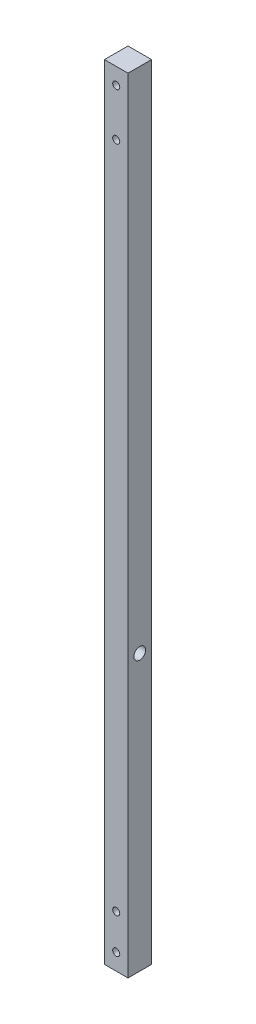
from build123d import *

# Parameters (mm, degrees)
SKETCH1_W          = 10
SKETCH1_H          = 10
EXTRUDE1_DEPTH     = 333
SKETCH2_R          = 1.5
CUT_EXTRUDE1_DEPTH = 334.300165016
SKETCH3_R          = 2.5
CUT_EXTRUDE2_DEPTH = 334.300165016


with BuildPart() as part:
    # Sketch1 → Extrude1 (new body)
    with BuildSketch(Plane(origin=(0, 0, 0), x_dir=(1, 0, 0), z_dir=(0, 1, 0))):
        with Locations((5, 5)):
            Rectangle(SKETCH1_W, SKETCH1_H)
    extrude(amount=EXTRUDE1_DEPTH)

    # Sketch2 → Cut-Extrude1 (cut, through all)
    with BuildSketch(Plane.XY):
        with Locations((5, 326)):
            Circle(SKETCH2_R)
        with Locations((5, 306)):
            Circle(SKETCH2_R)
        with Locations((5, 22)):
            Circle(SKETCH2_R)
        with Locations((5, 7)):
            Circle(SKETCH2_R)
    extrude(amount=-CUT_EXTRUDE1_DEPTH, mode=Mode.SUBTRACT)

    # Sketch3 → Cut-Extrude2 (cut, through all)
    with BuildSketch(Plane(origin=(10, 0, 0), x_dir=(0, 0, -1), z_dir=(1, 0, 0))):
        with Locations((5, 117)):
            Circle(SKETCH3_R)
    extrude(amount=-CUT_EXTRUDE2_DEPTH, mode=Mode.SUBTRACT)


solid = part.part
